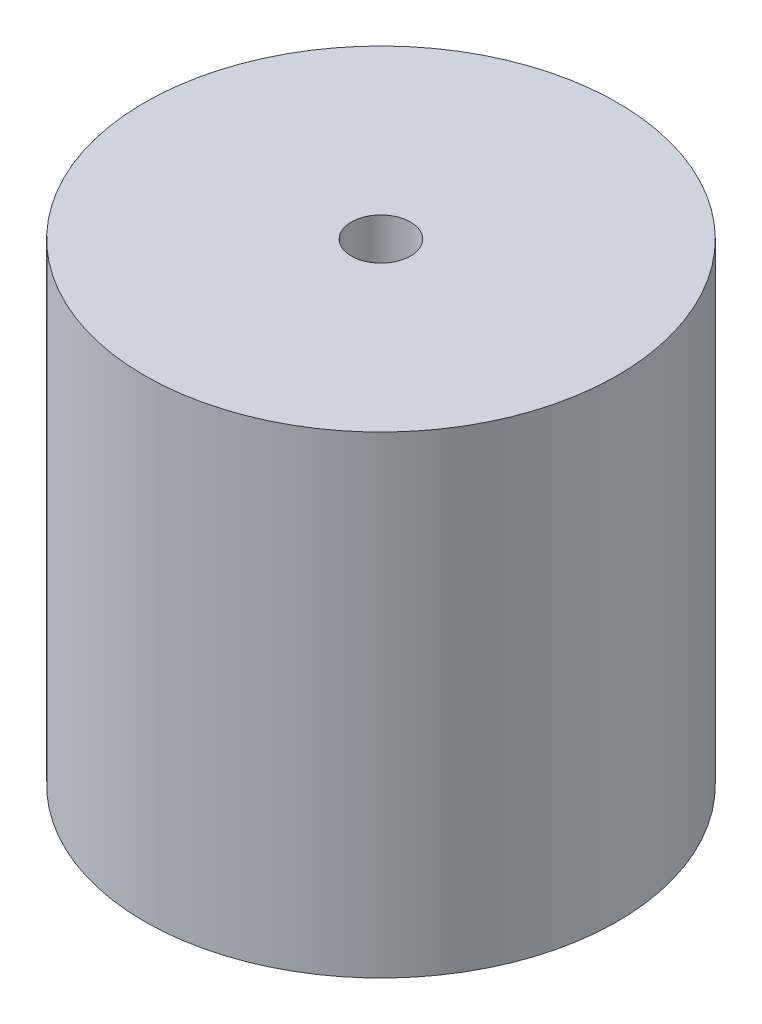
ISO-10303-21;
HEADER;
FILE_DESCRIPTION(('STEP AP214'),'2;1');
FILE_NAME('part.step','',(''),(''),'','','');
FILE_SCHEMA(('AUTOMOTIVE_DESIGN { 1 0 10303 214 1 1 1 1 }'));
ENDSEC;
DATA;
#1=APPLICATION_CONTEXT('core data for automotive mechanical design processes');
#2=APPLICATION_PROTOCOL_DEFINITION('international standard','automotive_design',2000,#1);
#3=PRODUCT_CONTEXT('',#1,'mechanical');
#4=PRODUCT('Part','Part','',(#3));
#5=PRODUCT_RELATED_PRODUCT_CATEGORY('part','',(#4));
#6=PRODUCT_DEFINITION_FORMATION('','',#4);
#7=PRODUCT_DEFINITION_CONTEXT('part definition',#1,'design');
#8=PRODUCT_DEFINITION('design','',#6,#7);
#9=PRODUCT_DEFINITION_SHAPE('','',#8);
#10=(LENGTH_UNIT() NAMED_UNIT(*) SI_UNIT(.MILLI.,.METRE.));
#11=(NAMED_UNIT(*) PLANE_ANGLE_UNIT() SI_UNIT($,.RADIAN.));
#12=(NAMED_UNIT(*) SI_UNIT($,.STERADIAN.) SOLID_ANGLE_UNIT());
#13=UNCERTAINTY_MEASURE_WITH_UNIT(LENGTH_MEASURE(1.E-05),#10,'distance_accuracy_value','');
#14=(GEOMETRIC_REPRESENTATION_CONTEXT(3) GLOBAL_UNCERTAINTY_ASSIGNED_CONTEXT((#13)) GLOBAL_UNIT_ASSIGNED_CONTEXT((#10,
#11,#12)) REPRESENTATION_CONTEXT('',''));
#15=CARTESIAN_POINT('',(0.,0.,0.));
#16=DIRECTION('',(0.,0.,1.));
#17=DIRECTION('',(1.,0.,0.));
#18=AXIS2_PLACEMENT_3D('',#15,#16,#17);
#19=CARTESIAN_POINT('',(0.,25.4,0.));
#20=DIRECTION('',(0.,-1.,0.));
#21=DIRECTION('',(0.,0.,-1.));
#22=AXIS2_PLACEMENT_3D('',#19,#20,#21);
#23=CYLINDRICAL_SURFACE('',#22,12.7);
#24=CARTESIAN_POINT('',(0.,25.4,0.));
#25=DIRECTION('',(0.,1.,0.));
#26=DIRECTION('',(0.,0.,1.));
#27=AXIS2_PLACEMENT_3D('',#24,#25,#26);
#28=CIRCLE('',#27,12.7);
#29=CARTESIAN_POINT('',(0.,25.4,12.7));
#30=VERTEX_POINT('',#29);
#31=EDGE_CURVE('E10',#30,#30,#28,.T.);
#32=ORIENTED_EDGE('',*,*,#31,.F.);
#33=EDGE_LOOP('',(#32));
#34=FACE_BOUND('',#33,.T.);
#35=CARTESIAN_POINT('',(0.,0.,0.));
#36=DIRECTION('',(0.,1.,0.));
#37=DIRECTION('',(0.,0.,1.));
#38=AXIS2_PLACEMENT_3D('',#35,#36,#37);
#39=CIRCLE('',#38,12.7);
#40=CARTESIAN_POINT('',(0.,0.,12.7));
#41=VERTEX_POINT('',#40);
#42=EDGE_CURVE('E33',#41,#41,#39,.T.);
#43=ORIENTED_EDGE('',*,*,#42,.T.);
#44=EDGE_LOOP('',(#43));
#45=FACE_BOUND('',#44,.T.);
#46=ADVANCED_FACE('F30',(#34,#45),#23,.T.);
#47=CARTESIAN_POINT('',(0.,25.4,0.));
#48=DIRECTION('',(0.,1.,0.));
#49=DIRECTION('',(0.,0.,1.));
#50=AXIS2_PLACEMENT_3D('',#47,#48,#49);
#51=PLANE('',#50);
#52=CARTESIAN_POINT('',(0.,25.4,0.));
#53=DIRECTION('',(0.,1.,0.));
#54=DIRECTION('',(0.,0.,1.));
#55=AXIS2_PLACEMENT_3D('',#52,#53,#54);
#56=CIRCLE('',#55,1.5875);
#57=CARTESIAN_POINT('',(0.,25.4,1.5875));
#58=VERTEX_POINT('',#57);
#59=EDGE_CURVE('E44',#58,#58,#56,.T.);
#60=ORIENTED_EDGE('',*,*,#59,.F.);
#61=EDGE_LOOP('',(#60));
#62=FACE_BOUND('',#61,.T.);
#63=ORIENTED_EDGE('',*,*,#31,.T.);
#64=EDGE_LOOP('',(#63));
#65=FACE_BOUND('',#64,.T.);
#66=ADVANCED_FACE('F50',(#62,#65),#51,.T.);
#67=CARTESIAN_POINT('',(0.,0.,0.));
#68=DIRECTION('',(0.,1.,0.));
#69=DIRECTION('',(0.,0.,1.));
#70=AXIS2_PLACEMENT_3D('',#67,#68,#69);
#71=PLANE('',#70);
#72=CARTESIAN_POINT('',(0.,0.,0.));
#73=DIRECTION('',(0.,1.,0.));
#74=DIRECTION('',(0.,0.,1.));
#75=AXIS2_PLACEMENT_3D('',#72,#73,#74);
#76=CIRCLE('',#75,1.58749999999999);
#77=CARTESIAN_POINT('',(0.,0.,1.58749999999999));
#78=VERTEX_POINT('',#77);
#79=EDGE_CURVE('E40',#78,#78,#76,.T.);
#80=ORIENTED_EDGE('',*,*,#79,.T.);
#81=EDGE_LOOP('',(#80));
#82=FACE_BOUND('',#81,.T.);
#83=ORIENTED_EDGE('',*,*,#42,.F.);
#84=EDGE_LOOP('',(#83));
#85=FACE_BOUND('',#84,.T.);
#86=ADVANCED_FACE('F52',(#82,#85),#71,.F.);
#87=CARTESIAN_POINT('',(0.,25.4,0.));
#88=DIRECTION('',(0.,1.,0.));
#89=DIRECTION('',(0.,0.,1.));
#90=AXIS2_PLACEMENT_3D('',#87,#88,#89);
#91=CYLINDRICAL_SURFACE('',#90,1.5875);
#92=ORIENTED_EDGE('',*,*,#79,.F.);
#93=EDGE_LOOP('',(#92));
#94=FACE_BOUND('',#93,.T.);
#95=ORIENTED_EDGE('',*,*,#59,.T.);
#96=EDGE_LOOP('',(#95));
#97=FACE_BOUND('',#96,.T.);
#98=ADVANCED_FACE('F48',(#94,#97),#91,.F.);
#99=CLOSED_SHELL('',(#46,#66,#86,#98));
#100=MANIFOLD_SOLID_BREP('B2',#99);
#101=ADVANCED_BREP_SHAPE_REPRESENTATION('',(#18,#100),#14);
#102=SHAPE_DEFINITION_REPRESENTATION(#9,#101);
ENDSEC;
END-ISO-10303-21;
